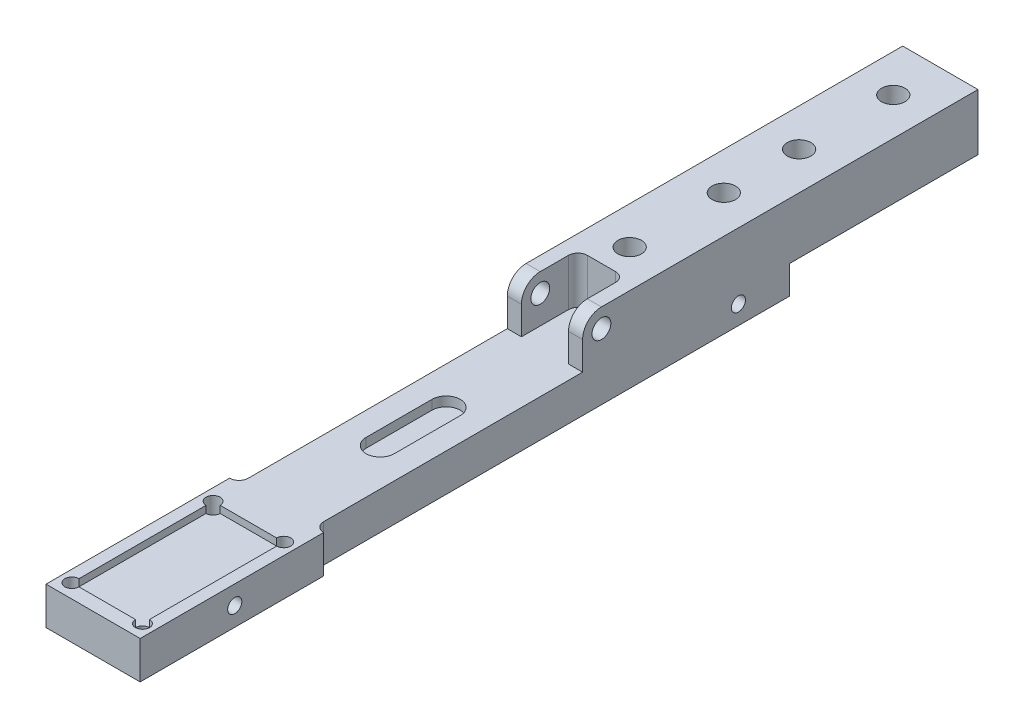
from build123d import *

# Parameters (mm, degrees)
SKETCH1_W               = 140
SKETCH1_H               = 6
BOSS_EXTRUDE1_DEPTH     = 10
SKETCH2_R               = 2
BOSS_EXTRUDE2_DEPTH     = 10
SKETCH6_W               = 2
SKETCH6_H               = 12
CUT_EXTRUDE3_DEPTH      = 98.529482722
CUT_EXTRUDE4_DEPTH      = 10
SKETCH8_W               = 16
SKETCH8_H               = 2
BOSS_EXTRUDE3_DEPTH     = 15
SKETCH9_W               = 20
SKETCH9_H               = 2
BOSS_EXTRUDE4_DEPTH     = 81
CUT_EXTRUDE6_DEPTH      = 102.212647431
CUT_EXTRUDE6_DEPTH_BACK = 102.212647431
SKETCH12_W              = 16
SKETCH12_H              = 12
BOSS_EXTRUDE5_DEPTH     = 40
SKETCH13_R              = 1.5
CUT_EXTRUDE7_DEPTH      = 101.995049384
SKETCH14_W              = 15
SKETCH14_H              = 30
CUT_EXTRUDE8_DEPTH      = 1.5
CUT_EXTRUDE9_DEPTH      = 2
SKETCH16_R              = 2.5
CUT_EXTRUDE10_DEPTH     = 103.097992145
SKETCH17_R              = 2.5
CUT_EXTRUDE11_DEPTH     = 102.212647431
SKETCH18_R              = 1.5
CUT_EXTRUDE12_DEPTH     = 15
SKETCH19_R              = 1.5
CUT_EXTRUDE13_DEPTH     = 15


with BuildPart() as part:
    # Sketch1 → Boss-Extrude1 (new, symmetric)
    with BuildSketch(Plane(origin=(0, 0, 0), x_dir=(0, 0, -1), z_dir=(1, 0, 0))):
        with Locations((-30, -11)):
            Rectangle(SKETCH1_W, SKETCH1_H)
    extrude(amount=BOSS_EXTRUDE1_DEPTH, both=True)

    # Sketch2 → Boss-Extrude2 (add, symmetric)
    with BuildSketch(Plane(origin=(0, 0, 0), x_dir=(0, 0, -1), z_dir=(1, 0, 0))):
        with BuildLine():
            Line((-4, -8), (4, -8))
            Line((4, -8), (40, -8))
            Line((40, -8), (40, 4))
            Line((40, 4), (0, 4))
            ThreePointArc((0, 4), (-2.828427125, 2.828427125), (-4, 0))
            Line((-4, 0), (-4, -8))
        make_face()
        Circle(SKETCH2_R, mode=Mode.SUBTRACT)
    extrude(amount=BOSS_EXTRUDE2_DEPTH, both=True)

    # Sketch6 → Cut-Extrude3 (cut, through all)
    with BuildSketch(Plane.XY.offset(4)):
        with Locations((-9, -2)):
            Rectangle(SKETCH6_W, SKETCH6_H)
        with Locations((9, -2)):
            Rectangle(SKETCH6_W, SKETCH6_H)
    extrude(amount=-CUT_EXTRUDE3_DEPTH, mode=Mode.SUBTRACT)

    # Sketch7 → Cut-Extrude4 (cut)
    with BuildSketch(Plane(origin=(0, 4, 0), x_dir=(1, 0, 0), z_dir=(0, 1, 0))):
        with BuildLine():
            Line((-5, -4), (5, -4))
            Line((5, -4), (5, 6))
            ThreePointArc((5, 6), (4.414213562, 7.414213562), (3, 8))
            Line((3, 8), (-3, 8))
            ThreePointArc((-3, 8), (-4.414213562, 7.414213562), (-5, 6))
            Line((-5, 6), (-5, -4))
        make_face()
    extrude(amount=-CUT_EXTRUDE4_DEPTH, mode=Mode.SUBTRACT)

    # Sketch8 → Boss-Extrude3 (add)
    with BuildSketch(Plane.XY.offset(4)):
        with Locations((0, -7)):
            Rectangle(SKETCH8_W, SKETCH8_H)
    extrude(amount=BOSS_EXTRUDE3_DEPTH)

    # Sketch9 → Boss-Extrude4 (add)
    with BuildSketch(Plane.XY.offset(19)):
        with Locations((0, -7)):
            Rectangle(SKETCH9_W, SKETCH9_H)
    extrude(amount=BOSS_EXTRUDE4_DEPTH)

    # Sketch11 → Cut-Extrude6 (cut, two sides: drawn at the far end of the back side and taken through both)
    with BuildSketch(Plane(origin=(0, -8, 0), x_dir=(1, 0, 0), z_dir=(0, 1, 0)).offset(-CUT_EXTRUDE6_DEPTH_BACK)):
        with BuildLine():
            Line((-10, -59), (-10, -61))
            ThreePointArc((-10, -61), (-8.585786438, -60.414213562), (-8, -59))
            Line((-8, -59), (-8, 40))
            Line((-8, 40), (-10, 40))
            Line((-10, 40), (-10, -59))
        make_face()
        with BuildLine():
            Line((10, 40), (8, 40))
            Line((8, 40), (8, -59))
            ThreePointArc((8, -59), (8.585786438, -60.414213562), (10, -61))
            Line((10, -61), (10, -59))
            Line((10, -59), (10, 40))
        make_face()
    extrude(amount=CUT_EXTRUDE6_DEPTH + CUT_EXTRUDE6_DEPTH_BACK, mode=Mode.SUBTRACT)

    # Sketch12 → Boss-Extrude5 (add)
    with BuildSketch(Plane(origin=(0, 0, -40), x_dir=(-1, 0, 0), z_dir=(0, 0, -1))):
        with Locations((0, -2)):
            Rectangle(SKETCH12_W, SKETCH12_H)
    extrude(amount=BOSS_EXTRUDE5_DEPTH)

    # Sketch13 → Cut-Extrude7 (cut, through all)
    with BuildSketch(Plane(origin=(0, -6, 0), x_dir=(1, 0, 0), z_dir=(0, 1, 0))):
        with Locations(Location((7.5, -97, 0), (0, 0, 270))):
            Circle(SKETCH13_R)
        with Locations(Location((7.5, -67, 0), (0, 0, 270))):
            Circle(SKETCH13_R)
        with Locations(Location((-7.5, -67, 0), (0, 0, 270))):
            Circle(SKETCH13_R)
        with Locations(Location((-7.5, -97, 0), (0, 0, 270))):
            Circle(SKETCH13_R)
    extrude(amount=-CUT_EXTRUDE7_DEPTH, mode=Mode.SUBTRACT)

    # Sketch14 → Cut-Extrude8 (cut)
    with BuildSketch(Plane(origin=(0, -6, 0), x_dir=(1, 0, 0), z_dir=(0, 1, 0))):
        with Locations((0, -82)):
            Rectangle(SKETCH14_W, SKETCH14_H)
    extrude(amount=-CUT_EXTRUDE8_DEPTH, mode=Mode.SUBTRACT)

    # Sketch15 → Cut-Extrude9 (cut)
    with BuildSketch(Plane(origin=(0, -6, 0), x_dir=(1, 0, 0), z_dir=(0, 1, 0))):
        with BuildLine():
            Line((3, -25), (3, -39))
            ThreePointArc((3, -39), (0, -42), (-3, -39))
            Line((-3, -39), (-3, -25))
            ThreePointArc((-3, -25), (0, -22), (3, -25))
        make_face()
    extrude(amount=-CUT_EXTRUDE9_DEPTH, mode=Mode.SUBTRACT)

    # Sketch16 → Cut-Extrude10 (cut, through all)
    with BuildSketch(Plane.XZ.offset(14)):
        with Locations(Location((0, -34, 0), (0, 0, 270))):
            Circle(SKETCH16_R)
        with Locations(Location((0, -14, 0), (0, 0, 270))):
            Circle(SKETCH16_R)
    extrude(amount=-CUT_EXTRUDE10_DEPTH, mode=Mode.SUBTRACT)

    # Sketch17 → Cut-Extrude11 (cut, through all)
    with BuildSketch(Plane.XZ.offset(8)):
        with Locations((0, -70)):
            Circle(SKETCH17_R)
        with Locations((0, -50)):
            Circle(SKETCH17_R)
    extrude(amount=-CUT_EXTRUDE11_DEPTH, mode=Mode.SUBTRACT)

    # Sketch18 → Cut-Extrude12 (cut)
    with BuildSketch(Plane(origin=(8, 0, 0), x_dir=(0, 0, -1), z_dir=(1, 0, 0))):
        with Locations((29.1, -10)):
            Circle(SKETCH18_R)
    extrude(amount=-CUT_EXTRUDE12_DEPTH, mode=Mode.SUBTRACT)

    # Sketch19 → Cut-Extrude13 (cut)
    with BuildSketch(Plane(origin=(10, 0, 0), x_dir=(0, 0, -1), z_dir=(1, 0, 0))):
        with Locations((-79.9, -10)):
            Circle(SKETCH19_R)
    extrude(amount=-CUT_EXTRUDE13_DEPTH, mode=Mode.SUBTRACT)


solid = part.part
